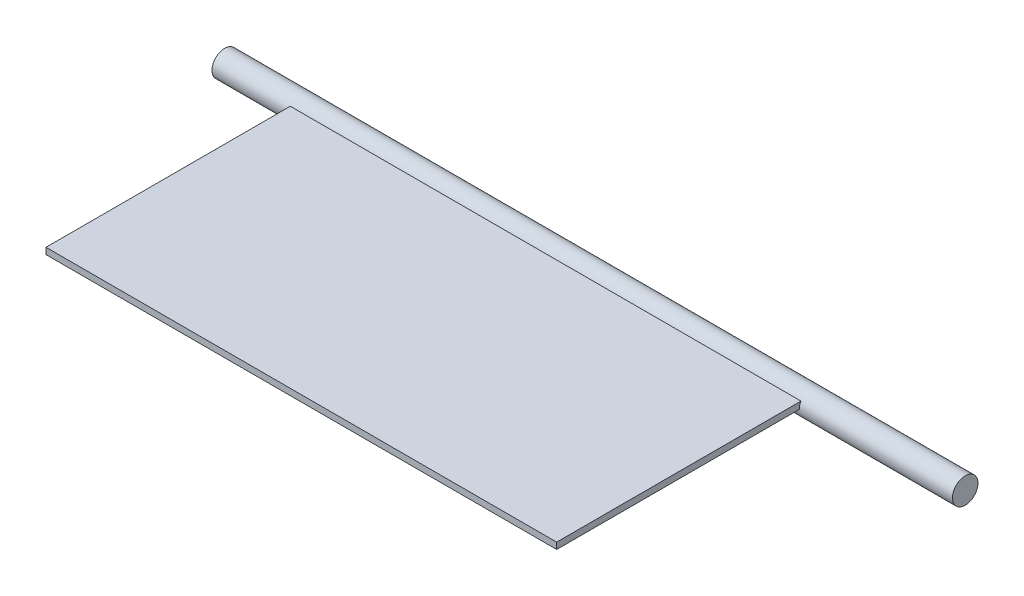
from build123d import *
from build123d.topology import SkipClean

# Parameters (mm, degrees)
BOSS_EXTRU_1_DEPTH      = 460
ESQUISSE3_R             = 10
ENL_V_MAT_EXTRU_1_DEPTH = 60


with BuildPart() as part:
    # Esquisse1 → Boss.-Extru.1 (new body)
    with BuildSketch(Plane(origin=(0, 0, 0), x_dir=(0, 0, -1), z_dir=(1, 0, 0))):
        with BuildLine():
            Line((-10, 0), (-200, 0))
            Line((-200, 0), (-200, 5))
            Line((-200, 5), (-8.660254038, 5))
            ThreePointArc((-8.660254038, 5), (-9.659258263, 2.588190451), (-10, 0))
        make_face()
    extrude(amount=BOSS_EXTRU_1_DEPTH)

    # Balayage1: sweep along a path in Esquisse2
    with BuildLine(Plane(origin=(0, 0, 0), x_dir=(1, 0, 0), z_dir=(0, 1, 0))) as balayage1_path:
        Line((580, 0), (0, 0))
    # Esquisse3 → Balayage1 (sweep)
    with BuildSketch(Plane(origin=(0, 0, 0), x_dir=(0, 0, -1), z_dir=(1, 0, 0))):
        Circle(ESQUISSE3_R)
    sweep(path=balayage1_path.line)

    # Esquisse1_4 → Enl_v. mat.-Extru.1 (cut)
    with SkipClean():  # the faces are left unmerged after this step: merging them gives an invalid solid
        with BuildSketch(Plane(origin=(0, 0, 0), x_dir=(0, 0, -1), z_dir=(1, 0, 0))):
            with BuildLine():
                Line((-10, 0), (-200, 0))
                Line((-200, 0), (-200, 5))
                Line((-200, 5), (-8.660254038, 5))
                ThreePointArc((-8.660254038, 5), (-9.659258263, 2.588190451), (-10, 0))
            make_face()
        extrude(amount=ENL_V_MAT_EXTRU_1_DEPTH, mode=Mode.SUBTRACT)


solid = part.part
